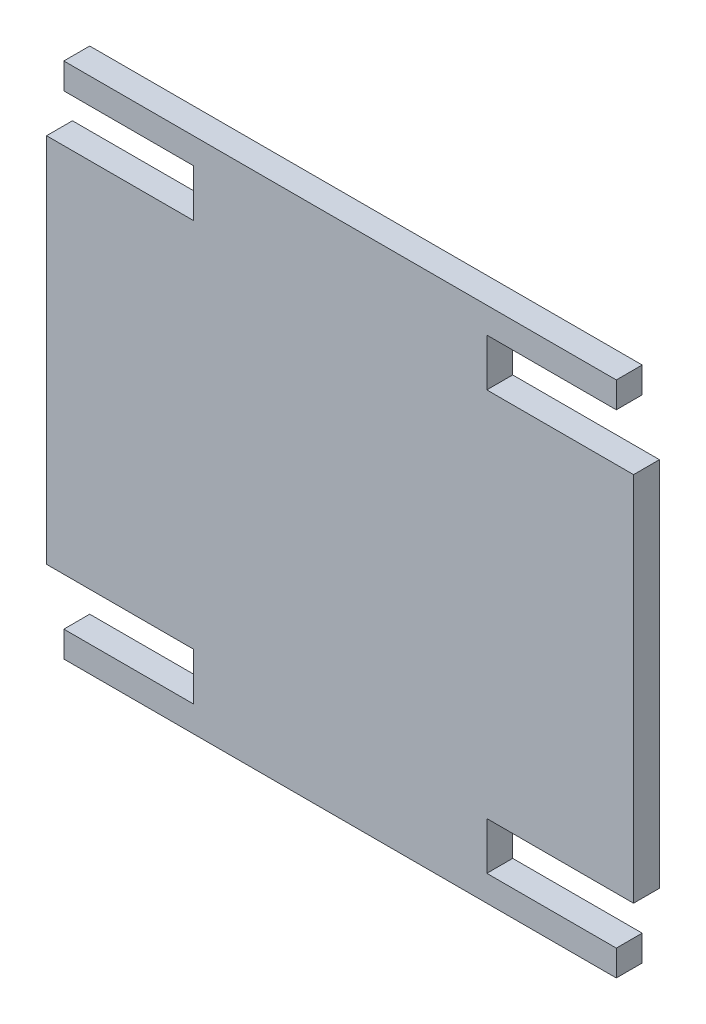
ISO-10303-21;
HEADER;
FILE_DESCRIPTION(('STEP AP214'),'2;1');
FILE_NAME('part.step','',(''),(''),'','','');
FILE_SCHEMA(('AUTOMOTIVE_DESIGN { 1 0 10303 214 1 1 1 1 }'));
ENDSEC;
DATA;
#1=APPLICATION_CONTEXT('core data for automotive mechanical design processes');
#2=APPLICATION_PROTOCOL_DEFINITION('international standard','automotive_design',2000,#1);
#3=PRODUCT_CONTEXT('',#1,'mechanical');
#4=PRODUCT('Part','Part','',(#3));
#5=PRODUCT_RELATED_PRODUCT_CATEGORY('part','',(#4));
#6=PRODUCT_DEFINITION_FORMATION('','',#4);
#7=PRODUCT_DEFINITION_CONTEXT('part definition',#1,'design');
#8=PRODUCT_DEFINITION('design','',#6,#7);
#9=PRODUCT_DEFINITION_SHAPE('','',#8);
#10=(LENGTH_UNIT() NAMED_UNIT(*) SI_UNIT(.MILLI.,.METRE.));
#11=(NAMED_UNIT(*) PLANE_ANGLE_UNIT() SI_UNIT($,.RADIAN.));
#12=(NAMED_UNIT(*) SI_UNIT($,.STERADIAN.) SOLID_ANGLE_UNIT());
#13=UNCERTAINTY_MEASURE_WITH_UNIT(LENGTH_MEASURE(1.E-05),#10,'distance_accuracy_value','');
#14=(GEOMETRIC_REPRESENTATION_CONTEXT(3) GLOBAL_UNCERTAINTY_ASSIGNED_CONTEXT((#13)) GLOBAL_UNIT_ASSIGNED_CONTEXT((#10,
#11,#12)) REPRESENTATION_CONTEXT('',''));
#15=CARTESIAN_POINT('',(0.,0.,0.));
#16=DIRECTION('',(0.,0.,1.));
#17=DIRECTION('',(1.,0.,0.));
#18=AXIS2_PLACEMENT_3D('',#15,#16,#17);
#19=CARTESIAN_POINT('',(-3.19999614,3.00000162,0.2999994));
#20=DIRECTION('',(0.,0.,1.));
#21=DIRECTION('',(1.,0.,0.));
#22=AXIS2_PLACEMENT_3D('',#19,#20,#21);
#23=PLANE('',#22);
#24=DIRECTION('',(0.,1.,0.));
#25=VECTOR('',#24,1.);
#26=CARTESIAN_POINT('',(3.20000122,3.00000162,0.2999994));
#27=LINE('',#26,#25);
#28=CARTESIAN_POINT('',(3.20000122,3.00000162,0.2999994));
#29=VERTEX_POINT('',#28);
#30=CARTESIAN_POINT('',(3.20000122,2.69999968,0.2999994));
#31=VERTEX_POINT('',#30);
#32=EDGE_CURVE('E237',#29,#31,#27,.F.);
#33=ORIENTED_EDGE('',*,*,#32,.F.);
#34=DIRECTION('',(1.,0.,0.));
#35=VECTOR('',#34,1.);
#36=CARTESIAN_POINT('',(-3.19999614,3.00000162,0.2999994));
#37=LINE('',#36,#35);
#38=CARTESIAN_POINT('',(-3.19999614,3.00000162,0.2999994));
#39=VERTEX_POINT('',#38);
#40=EDGE_CURVE('E166',#39,#29,#37,.T.);
#41=ORIENTED_EDGE('',*,*,#40,.F.);
#42=DIRECTION('',(0.,1.,0.));
#43=VECTOR('',#42,1.);
#44=CARTESIAN_POINT('',(-3.19999614,2.70000222,0.2999994));
#45=LINE('',#44,#43);
#46=CARTESIAN_POINT('',(-3.19999614,2.70000222,0.2999994));
#47=VERTEX_POINT('',#46);
#48=EDGE_CURVE('E20',#47,#39,#45,.T.);
#49=ORIENTED_EDGE('',*,*,#48,.F.);
#50=DIRECTION('',(1.,0.,0.));
#51=VECTOR('',#50,1.);
#52=CARTESIAN_POINT('',(-1.69999914,2.70000222,0.2999994));
#53=LINE('',#52,#51);
#54=CARTESIAN_POINT('',(-1.69999914,2.70000222,0.2999994));
#55=VERTEX_POINT('',#54);
#56=EDGE_CURVE('E155',#55,#47,#53,.F.);
#57=ORIENTED_EDGE('',*,*,#56,.F.);
#58=DIRECTION('',(0.,1.,0.));
#59=VECTOR('',#58,1.);
#60=CARTESIAN_POINT('',(-1.69999914,2.15000078,0.2999994));
#61=LINE('',#60,#59);
#62=CARTESIAN_POINT('',(-1.69999914,2.15000078,0.2999994));
#63=VERTEX_POINT('',#62);
#64=EDGE_CURVE('E150',#63,#55,#61,.T.);
#65=ORIENTED_EDGE('',*,*,#64,.F.);
#66=DIRECTION('',(1.,0.,0.));
#67=VECTOR('',#66,1.);
#68=CARTESIAN_POINT('',(-3.39999828,2.15000078,0.2999994));
#69=LINE('',#68,#67);
#70=CARTESIAN_POINT('',(-3.39999828,2.15000078,0.2999994));
#71=VERTEX_POINT('',#70);
#72=EDGE_CURVE('E177',#71,#63,#69,.T.);
#73=ORIENTED_EDGE('',*,*,#72,.F.);
#74=DIRECTION('',(0.,1.,0.));
#75=VECTOR('',#74,1.);
#76=CARTESIAN_POINT('',(-3.39999828,-2.1499957,0.2999994));
#77=LINE('',#76,#75);
#78=CARTESIAN_POINT('',(-3.39999828,-2.1499957,0.2999994));
#79=VERTEX_POINT('',#78);
#80=EDGE_CURVE('E181',#79,#71,#77,.T.);
#81=ORIENTED_EDGE('',*,*,#80,.F.);
#82=DIRECTION('',(1.,0.,0.));
#83=VECTOR('',#82,1.);
#84=CARTESIAN_POINT('',(-1.70000168,-2.1499957,0.2999994));
#85=LINE('',#84,#83);
#86=CARTESIAN_POINT('',(-1.70000168,-2.1499957,0.2999994));
#87=VERTEX_POINT('',#86);
#88=EDGE_CURVE('E185',#87,#79,#85,.F.);
#89=ORIENTED_EDGE('',*,*,#88,.F.);
#90=DIRECTION('',(0.,1.,0.));
#91=VECTOR('',#90,1.);
#92=CARTESIAN_POINT('',(-1.70000168,-2.69999714,0.2999994));
#93=LINE('',#92,#91);
#94=CARTESIAN_POINT('',(-1.70000168,-2.69999714,0.2999994));
#95=VERTEX_POINT('',#94);
#96=EDGE_CURVE('E189',#95,#87,#93,.T.);
#97=ORIENTED_EDGE('',*,*,#96,.F.);
#98=DIRECTION('',(1.,0.,0.));
#99=VECTOR('',#98,1.);
#100=CARTESIAN_POINT('',(-3.19999868,-2.69999714,0.2999994));
#101=LINE('',#100,#99);
#102=CARTESIAN_POINT('',(-3.19999868,-2.69999714,0.2999994));
#103=VERTEX_POINT('',#102);
#104=EDGE_CURVE('E193',#103,#95,#101,.T.);
#105=ORIENTED_EDGE('',*,*,#104,.F.);
#106=DIRECTION('',(0.,1.,0.));
#107=VECTOR('',#106,1.);
#108=CARTESIAN_POINT('',(-3.19999868,-2.99999908,0.2999994));
#109=LINE('',#108,#107);
#110=CARTESIAN_POINT('',(-3.19999868,-2.99999908,0.2999994));
#111=VERTEX_POINT('',#110);
#112=EDGE_CURVE('E197',#111,#103,#109,.T.);
#113=ORIENTED_EDGE('',*,*,#112,.F.);
#114=DIRECTION('',(1.,0.,0.));
#115=VECTOR('',#114,1.);
#116=CARTESIAN_POINT('',(3.19999868,-2.99999908,0.2999994));
#117=LINE('',#116,#115);
#118=CARTESIAN_POINT('',(3.19999868,-2.99999908,0.2999994));
#119=VERTEX_POINT('',#118);
#120=EDGE_CURVE('E201',#119,#111,#117,.F.);
#121=ORIENTED_EDGE('',*,*,#120,.F.);
#122=DIRECTION('',(0.,1.,0.));
#123=VECTOR('',#122,1.);
#124=CARTESIAN_POINT('',(3.19999868,-2.69999968,0.2999994));
#125=LINE('',#124,#123);
#126=CARTESIAN_POINT('',(3.19999868,-2.69999968,0.2999994));
#127=VERTEX_POINT('',#126);
#128=EDGE_CURVE('E205',#127,#119,#125,.F.);
#129=ORIENTED_EDGE('',*,*,#128,.F.);
#130=DIRECTION('',(1.,0.,0.));
#131=VECTOR('',#130,1.);
#132=CARTESIAN_POINT('',(1.70000168,-2.69999968,0.2999994));
#133=LINE('',#132,#131);
#134=CARTESIAN_POINT('',(1.70000168,-2.69999968,0.2999994));
#135=VERTEX_POINT('',#134);
#136=EDGE_CURVE('E209',#135,#127,#133,.T.);
#137=ORIENTED_EDGE('',*,*,#136,.F.);
#138=DIRECTION('',(0.,1.,0.));
#139=VECTOR('',#138,1.);
#140=CARTESIAN_POINT('',(1.70000168,-2.14999824,0.2999994));
#141=LINE('',#140,#139);
#142=CARTESIAN_POINT('',(1.70000168,-2.14999824,0.2999994));
#143=VERTEX_POINT('',#142);
#144=EDGE_CURVE('E213',#143,#135,#141,.F.);
#145=ORIENTED_EDGE('',*,*,#144,.F.);
#146=DIRECTION('',(1.,0.,0.));
#147=VECTOR('',#146,1.);
#148=CARTESIAN_POINT('',(3.40000082,-2.14999824,0.2999994));
#149=LINE('',#148,#147);
#150=CARTESIAN_POINT('',(3.40000082,-2.14999824,0.2999994));
#151=VERTEX_POINT('',#150);
#152=EDGE_CURVE('E217',#151,#143,#149,.F.);
#153=ORIENTED_EDGE('',*,*,#152,.F.);
#154=DIRECTION('',(0.,1.,0.));
#155=VECTOR('',#154,1.);
#156=CARTESIAN_POINT('',(3.40000082,2.14999824,0.2999994));
#157=LINE('',#156,#155);
#158=CARTESIAN_POINT('',(3.40000082,2.14999824,0.2999994));
#159=VERTEX_POINT('',#158);
#160=EDGE_CURVE('E221',#159,#151,#157,.F.);
#161=ORIENTED_EDGE('',*,*,#160,.F.);
#162=DIRECTION('',(1.,0.,0.));
#163=VECTOR('',#162,1.);
#164=CARTESIAN_POINT('',(1.70000422,2.14999824,0.2999994));
#165=LINE('',#164,#163);
#166=CARTESIAN_POINT('',(1.70000422,2.14999824,0.2999994));
#167=VERTEX_POINT('',#166);
#168=EDGE_CURVE('E225',#167,#159,#165,.T.);
#169=ORIENTED_EDGE('',*,*,#168,.F.);
#170=DIRECTION('',(0.,1.,0.));
#171=VECTOR('',#170,1.);
#172=CARTESIAN_POINT('',(1.70000422,2.69999968,0.2999994));
#173=LINE('',#172,#171);
#174=CARTESIAN_POINT('',(1.70000422,2.69999968,0.2999994));
#175=VERTEX_POINT('',#174);
#176=EDGE_CURVE('E229',#175,#167,#173,.F.);
#177=ORIENTED_EDGE('',*,*,#176,.F.);
#178=DIRECTION('',(1.,0.,0.));
#179=VECTOR('',#178,1.);
#180=CARTESIAN_POINT('',(3.20000122,2.69999968,0.2999994));
#181=LINE('',#180,#179);
#182=EDGE_CURVE('E233',#31,#175,#181,.F.);
#183=ORIENTED_EDGE('',*,*,#182,.F.);
#184=EDGE_LOOP('',(#33,#41,#49,#57,#65,#73,#81,#89,#97,#105,#113,#121,#129,#137,#145,#153,#161,
#169,#177,#183));
#185=FACE_BOUND('',#184,.T.);
#186=ADVANCED_FACE('F17',(#185),#23,.T.);
#187=CARTESIAN_POINT('',(-3.19999614,2.70000222,0.));
#188=DIRECTION('',(-1.,0.,0.));
#189=DIRECTION('',(0.,0.,1.));
#190=AXIS2_PLACEMENT_3D('',#187,#188,#189);
#191=PLANE('',#190);
#192=DIRECTION('',(0.,0.,1.));
#193=VECTOR('',#192,1.);
#194=CARTESIAN_POINT('',(-3.19999614,3.00000162,0.));
#195=LINE('',#194,#193);
#196=CARTESIAN_POINT('',(-3.19999614,3.00000162,0.));
#197=VERTEX_POINT('',#196);
#198=EDGE_CURVE('E241',#197,#39,#195,.T.);
#199=ORIENTED_EDGE('',*,*,#198,.F.);
#200=DIRECTION('',(0.,1.,0.));
#201=VECTOR('',#200,1.);
#202=CARTESIAN_POINT('',(-3.19999614,3.00000162,0.));
#203=LINE('',#202,#201);
#204=CARTESIAN_POINT('',(-3.19999614,2.70000222,0.));
#205=VERTEX_POINT('',#204);
#206=EDGE_CURVE('E172',#197,#205,#203,.F.);
#207=ORIENTED_EDGE('',*,*,#206,.T.);
#208=DIRECTION('',(0.,0.,-1.));
#209=VECTOR('',#208,1.);
#210=CARTESIAN_POINT('',(-3.19999614,2.70000222,0.));
#211=LINE('',#210,#209);
#212=EDGE_CURVE('E160',#47,#205,#211,.T.);
#213=ORIENTED_EDGE('',*,*,#212,.F.);
#214=ORIENTED_EDGE('',*,*,#48,.T.);
#215=EDGE_LOOP('',(#199,#207,#213,#214));
#216=FACE_BOUND('',#215,.T.);
#217=ADVANCED_FACE('F171',(#216),#191,.T.);
#218=CARTESIAN_POINT('',(-1.69999914,2.70000222,0.));
#219=DIRECTION('',(0.,-1.,0.));
#220=DIRECTION('',(0.,0.,-1.));
#221=AXIS2_PLACEMENT_3D('',#218,#219,#220);
#222=PLANE('',#221);
#223=ORIENTED_EDGE('',*,*,#212,.T.);
#224=DIRECTION('',(1.,0.,0.));
#225=VECTOR('',#224,1.);
#226=CARTESIAN_POINT('',(-3.19999614,2.70000222,0.));
#227=LINE('',#226,#225);
#228=CARTESIAN_POINT('',(-1.69999914,2.70000222,0.));
#229=VERTEX_POINT('',#228);
#230=EDGE_CURVE('E246',#205,#229,#227,.T.);
#231=ORIENTED_EDGE('',*,*,#230,.T.);
#232=DIRECTION('',(0.,0.,1.));
#233=VECTOR('',#232,1.);
#234=CARTESIAN_POINT('',(-1.69999914,2.70000222,0.));
#235=LINE('',#234,#233);
#236=EDGE_CURVE('E162',#55,#229,#235,.F.);
#237=ORIENTED_EDGE('',*,*,#236,.F.);
#238=ORIENTED_EDGE('',*,*,#56,.T.);
#239=EDGE_LOOP('',(#223,#231,#237,#238));
#240=FACE_BOUND('',#239,.T.);
#241=ADVANCED_FACE('F157',(#240),#222,.T.);
#242=CARTESIAN_POINT('',(-1.69999914,2.15000078,0.));
#243=DIRECTION('',(-1.,0.,0.));
#244=DIRECTION('',(0.,0.,1.));
#245=AXIS2_PLACEMENT_3D('',#242,#243,#244);
#246=PLANE('',#245);
#247=ORIENTED_EDGE('',*,*,#236,.T.);
#248=DIRECTION('',(0.,1.,0.));
#249=VECTOR('',#248,1.);
#250=CARTESIAN_POINT('',(-1.69999914,3.00000162,0.));
#251=LINE('',#250,#249);
#252=CARTESIAN_POINT('',(-1.69999914,2.15000078,0.));
#253=VERTEX_POINT('',#252);
#254=EDGE_CURVE('E248',#229,#253,#251,.F.);
#255=ORIENTED_EDGE('',*,*,#254,.T.);
#256=DIRECTION('',(0.,0.,1.));
#257=VECTOR('',#256,1.);
#258=CARTESIAN_POINT('',(-1.69999914,2.15000078,0.));
#259=LINE('',#258,#257);
#260=EDGE_CURVE('E179',#63,#253,#259,.F.);
#261=ORIENTED_EDGE('',*,*,#260,.F.);
#262=ORIENTED_EDGE('',*,*,#64,.T.);
#263=EDGE_LOOP('',(#247,#255,#261,#262));
#264=FACE_BOUND('',#263,.T.);
#265=ADVANCED_FACE('F378',(#264),#246,.T.);
#266=CARTESIAN_POINT('',(-3.39999828,2.15000078,0.));
#267=DIRECTION('',(0.,1.,0.));
#268=DIRECTION('',(0.,0.,1.));
#269=AXIS2_PLACEMENT_3D('',#266,#267,#268);
#270=PLANE('',#269);
#271=ORIENTED_EDGE('',*,*,#260,.T.);
#272=DIRECTION('',(1.,0.,0.));
#273=VECTOR('',#272,1.);
#274=CARTESIAN_POINT('',(-3.19999614,2.15000078,0.));
#275=LINE('',#274,#273);
#276=CARTESIAN_POINT('',(-3.39999828,2.15000078,0.));
#277=VERTEX_POINT('',#276);
#278=EDGE_CURVE('E251',#253,#277,#275,.F.);
#279=ORIENTED_EDGE('',*,*,#278,.T.);
#280=DIRECTION('',(0.,0.,1.));
#281=VECTOR('',#280,1.);
#282=CARTESIAN_POINT('',(-3.39999828,2.15000078,0.));
#283=LINE('',#282,#281);
#284=EDGE_CURVE('E183',#71,#277,#283,.F.);
#285=ORIENTED_EDGE('',*,*,#284,.F.);
#286=ORIENTED_EDGE('',*,*,#72,.T.);
#287=EDGE_LOOP('',(#271,#279,#285,#286));
#288=FACE_BOUND('',#287,.T.);
#289=ADVANCED_FACE('F377',(#288),#270,.T.);
#290=CARTESIAN_POINT('',(-3.39999828,-2.1499957,0.));
#291=DIRECTION('',(-1.,0.,0.));
#292=DIRECTION('',(0.,0.,1.));
#293=AXIS2_PLACEMENT_3D('',#290,#291,#292);
#294=PLANE('',#293);
#295=ORIENTED_EDGE('',*,*,#284,.T.);
#296=DIRECTION('',(0.,1.,0.));
#297=VECTOR('',#296,1.);
#298=CARTESIAN_POINT('',(-3.39999828,3.00000162,0.));
#299=LINE('',#298,#297);
#300=CARTESIAN_POINT('',(-3.39999828,-2.1499957,0.));
#301=VERTEX_POINT('',#300);
#302=EDGE_CURVE('E254',#277,#301,#299,.F.);
#303=ORIENTED_EDGE('',*,*,#302,.T.);
#304=DIRECTION('',(0.,0.,-1.));
#305=VECTOR('',#304,1.);
#306=CARTESIAN_POINT('',(-3.39999828,-2.1499957,0.));
#307=LINE('',#306,#305);
#308=EDGE_CURVE('E187',#79,#301,#307,.T.);
#309=ORIENTED_EDGE('',*,*,#308,.F.);
#310=ORIENTED_EDGE('',*,*,#80,.T.);
#311=EDGE_LOOP('',(#295,#303,#309,#310));
#312=FACE_BOUND('',#311,.T.);
#313=ADVANCED_FACE('F371',(#312),#294,.T.);
#314=CARTESIAN_POINT('',(-1.70000168,-2.1499957,0.));
#315=DIRECTION('',(0.,-1.,0.));
#316=DIRECTION('',(0.,0.,-1.));
#317=AXIS2_PLACEMENT_3D('',#314,#315,#316);
#318=PLANE('',#317);
#319=ORIENTED_EDGE('',*,*,#308,.T.);
#320=DIRECTION('',(1.,0.,0.));
#321=VECTOR('',#320,1.);
#322=CARTESIAN_POINT('',(-3.19999614,-2.1499957,0.));
#323=LINE('',#322,#321);
#324=CARTESIAN_POINT('',(-1.70000168,-2.1499957,0.));
#325=VERTEX_POINT('',#324);
#326=EDGE_CURVE('E257',#301,#325,#323,.T.);
#327=ORIENTED_EDGE('',*,*,#326,.T.);
#328=DIRECTION('',(0.,0.,1.));
#329=VECTOR('',#328,1.);
#330=CARTESIAN_POINT('',(-1.70000168,-2.1499957,0.));
#331=LINE('',#330,#329);
#332=EDGE_CURVE('E191',#87,#325,#331,.F.);
#333=ORIENTED_EDGE('',*,*,#332,.F.);
#334=ORIENTED_EDGE('',*,*,#88,.T.);
#335=EDGE_LOOP('',(#319,#327,#333,#334));
#336=FACE_BOUND('',#335,.T.);
#337=ADVANCED_FACE('F367',(#336),#318,.T.);
#338=CARTESIAN_POINT('',(-1.70000168,-2.69999714,0.));
#339=DIRECTION('',(-1.,0.,0.));
#340=DIRECTION('',(0.,0.,1.));
#341=AXIS2_PLACEMENT_3D('',#338,#339,#340);
#342=PLANE('',#341);
#343=ORIENTED_EDGE('',*,*,#332,.T.);
#344=DIRECTION('',(0.,1.,0.));
#345=VECTOR('',#344,1.);
#346=CARTESIAN_POINT('',(-1.70000168,3.00000162,0.));
#347=LINE('',#346,#345);
#348=CARTESIAN_POINT('',(-1.70000168,-2.69999714,0.));
#349=VERTEX_POINT('',#348);
#350=EDGE_CURVE('E260',#325,#349,#347,.F.);
#351=ORIENTED_EDGE('',*,*,#350,.T.);
#352=DIRECTION('',(0.,0.,1.));
#353=VECTOR('',#352,1.);
#354=CARTESIAN_POINT('',(-1.70000168,-2.69999714,0.));
#355=LINE('',#354,#353);
#356=EDGE_CURVE('E195',#95,#349,#355,.F.);
#357=ORIENTED_EDGE('',*,*,#356,.F.);
#358=ORIENTED_EDGE('',*,*,#96,.T.);
#359=EDGE_LOOP('',(#343,#351,#357,#358));
#360=FACE_BOUND('',#359,.T.);
#361=ADVANCED_FACE('F361',(#360),#342,.T.);
#362=CARTESIAN_POINT('',(-3.19999868,-2.69999714,0.));
#363=DIRECTION('',(0.,1.,0.));
#364=DIRECTION('',(0.,0.,1.));
#365=AXIS2_PLACEMENT_3D('',#362,#363,#364);
#366=PLANE('',#365);
#367=ORIENTED_EDGE('',*,*,#356,.T.);
#368=DIRECTION('',(1.,0.,0.));
#369=VECTOR('',#368,1.);
#370=CARTESIAN_POINT('',(-3.19999614,-2.69999714,0.));
#371=LINE('',#370,#369);
#372=CARTESIAN_POINT('',(-3.19999868,-2.69999714,0.));
#373=VERTEX_POINT('',#372);
#374=EDGE_CURVE('E263',#349,#373,#371,.F.);
#375=ORIENTED_EDGE('',*,*,#374,.T.);
#376=DIRECTION('',(0.,0.,1.));
#377=VECTOR('',#376,1.);
#378=CARTESIAN_POINT('',(-3.19999868,-2.69999714,0.));
#379=LINE('',#378,#377);
#380=EDGE_CURVE('E199',#103,#373,#379,.F.);
#381=ORIENTED_EDGE('',*,*,#380,.F.);
#382=ORIENTED_EDGE('',*,*,#104,.T.);
#383=EDGE_LOOP('',(#367,#375,#381,#382));
#384=FACE_BOUND('',#383,.T.);
#385=ADVANCED_FACE('F357',(#384),#366,.T.);
#386=CARTESIAN_POINT('',(-3.19999868,-2.99999908,0.));
#387=DIRECTION('',(-1.,0.,0.));
#388=DIRECTION('',(0.,0.,1.));
#389=AXIS2_PLACEMENT_3D('',#386,#387,#388);
#390=PLANE('',#389);
#391=ORIENTED_EDGE('',*,*,#380,.T.);
#392=DIRECTION('',(0.,1.,0.));
#393=VECTOR('',#392,1.);
#394=CARTESIAN_POINT('',(-3.19999868,3.00000162,0.));
#395=LINE('',#394,#393);
#396=CARTESIAN_POINT('',(-3.19999868,-2.99999908,0.));
#397=VERTEX_POINT('',#396);
#398=EDGE_CURVE('E266',#373,#397,#395,.F.);
#399=ORIENTED_EDGE('',*,*,#398,.T.);
#400=DIRECTION('',(0.,0.,-1.));
#401=VECTOR('',#400,1.);
#402=CARTESIAN_POINT('',(-3.19999868,-2.99999908,0.));
#403=LINE('',#402,#401);
#404=EDGE_CURVE('E203',#111,#397,#403,.T.);
#405=ORIENTED_EDGE('',*,*,#404,.F.);
#406=ORIENTED_EDGE('',*,*,#112,.T.);
#407=EDGE_LOOP('',(#391,#399,#405,#406));
#408=FACE_BOUND('',#407,.T.);
#409=ADVANCED_FACE('F351',(#408),#390,.T.);
#410=CARTESIAN_POINT('',(3.19999868,-2.99999908,0.));
#411=DIRECTION('',(0.,-1.,0.));
#412=DIRECTION('',(0.,0.,-1.));
#413=AXIS2_PLACEMENT_3D('',#410,#411,#412);
#414=PLANE('',#413);
#415=ORIENTED_EDGE('',*,*,#404,.T.);
#416=DIRECTION('',(1.,0.,0.));
#417=VECTOR('',#416,1.);
#418=CARTESIAN_POINT('',(-3.19999614,-2.99999908,0.));
#419=LINE('',#418,#417);
#420=CARTESIAN_POINT('',(3.19999868,-2.99999908,0.));
#421=VERTEX_POINT('',#420);
#422=EDGE_CURVE('E269',#397,#421,#419,.T.);
#423=ORIENTED_EDGE('',*,*,#422,.T.);
#424=DIRECTION('',(0.,0.,-1.));
#425=VECTOR('',#424,1.);
#426=CARTESIAN_POINT('',(3.19999868,-2.99999908,0.));
#427=LINE('',#426,#425);
#428=EDGE_CURVE('E207',#119,#421,#427,.T.);
#429=ORIENTED_EDGE('',*,*,#428,.F.);
#430=ORIENTED_EDGE('',*,*,#120,.T.);
#431=EDGE_LOOP('',(#415,#423,#429,#430));
#432=FACE_BOUND('',#431,.T.);
#433=ADVANCED_FACE('F347',(#432),#414,.T.);
#434=CARTESIAN_POINT('',(3.19999868,-2.69999968,0.));
#435=DIRECTION('',(1.,0.,0.));
#436=DIRECTION('',(0.,0.,-1.));
#437=AXIS2_PLACEMENT_3D('',#434,#435,#436);
#438=PLANE('',#437);
#439=ORIENTED_EDGE('',*,*,#428,.T.);
#440=DIRECTION('',(0.,1.,0.));
#441=VECTOR('',#440,1.);
#442=CARTESIAN_POINT('',(3.19999868,3.00000162,0.));
#443=LINE('',#442,#441);
#444=CARTESIAN_POINT('',(3.19999868,-2.69999968,0.));
#445=VERTEX_POINT('',#444);
#446=EDGE_CURVE('E272',#421,#445,#443,.T.);
#447=ORIENTED_EDGE('',*,*,#446,.T.);
#448=DIRECTION('',(0.,0.,1.));
#449=VECTOR('',#448,1.);
#450=CARTESIAN_POINT('',(3.19999868,-2.69999968,0.));
#451=LINE('',#450,#449);
#452=EDGE_CURVE('E211',#127,#445,#451,.F.);
#453=ORIENTED_EDGE('',*,*,#452,.F.);
#454=ORIENTED_EDGE('',*,*,#128,.T.);
#455=EDGE_LOOP('',(#439,#447,#453,#454));
#456=FACE_BOUND('',#455,.T.);
#457=ADVANCED_FACE('F341',(#456),#438,.T.);
#458=CARTESIAN_POINT('',(1.70000168,-2.69999968,0.));
#459=DIRECTION('',(0.,1.,0.));
#460=DIRECTION('',(0.,0.,1.));
#461=AXIS2_PLACEMENT_3D('',#458,#459,#460);
#462=PLANE('',#461);
#463=ORIENTED_EDGE('',*,*,#452,.T.);
#464=DIRECTION('',(1.,0.,0.));
#465=VECTOR('',#464,1.);
#466=CARTESIAN_POINT('',(-3.19999614,-2.69999968,0.));
#467=LINE('',#466,#465);
#468=CARTESIAN_POINT('',(1.70000168,-2.69999968,0.));
#469=VERTEX_POINT('',#468);
#470=EDGE_CURVE('E275',#445,#469,#467,.F.);
#471=ORIENTED_EDGE('',*,*,#470,.T.);
#472=DIRECTION('',(0.,0.,-1.));
#473=VECTOR('',#472,1.);
#474=CARTESIAN_POINT('',(1.70000168,-2.69999968,0.));
#475=LINE('',#474,#473);
#476=EDGE_CURVE('E215',#135,#469,#475,.T.);
#477=ORIENTED_EDGE('',*,*,#476,.F.);
#478=ORIENTED_EDGE('',*,*,#136,.T.);
#479=EDGE_LOOP('',(#463,#471,#477,#478));
#480=FACE_BOUND('',#479,.T.);
#481=ADVANCED_FACE('F337',(#480),#462,.T.);
#482=CARTESIAN_POINT('',(1.70000168,-2.14999824,0.));
#483=DIRECTION('',(1.,0.,0.));
#484=DIRECTION('',(0.,0.,-1.));
#485=AXIS2_PLACEMENT_3D('',#482,#483,#484);
#486=PLANE('',#485);
#487=ORIENTED_EDGE('',*,*,#476,.T.);
#488=DIRECTION('',(0.,1.,0.));
#489=VECTOR('',#488,1.);
#490=CARTESIAN_POINT('',(1.70000168,3.00000162,0.));
#491=LINE('',#490,#489);
#492=CARTESIAN_POINT('',(1.70000168,-2.14999824,0.));
#493=VERTEX_POINT('',#492);
#494=EDGE_CURVE('E278',#469,#493,#491,.T.);
#495=ORIENTED_EDGE('',*,*,#494,.T.);
#496=DIRECTION('',(0.,0.,-1.));
#497=VECTOR('',#496,1.);
#498=CARTESIAN_POINT('',(1.70000168,-2.14999824,0.));
#499=LINE('',#498,#497);
#500=EDGE_CURVE('E219',#143,#493,#499,.T.);
#501=ORIENTED_EDGE('',*,*,#500,.F.);
#502=ORIENTED_EDGE('',*,*,#144,.T.);
#503=EDGE_LOOP('',(#487,#495,#501,#502));
#504=FACE_BOUND('',#503,.T.);
#505=ADVANCED_FACE('F331',(#504),#486,.T.);
#506=CARTESIAN_POINT('',(3.40000082,-2.14999824,0.));
#507=DIRECTION('',(0.,-1.,0.));
#508=DIRECTION('',(0.,0.,-1.));
#509=AXIS2_PLACEMENT_3D('',#506,#507,#508);
#510=PLANE('',#509);
#511=ORIENTED_EDGE('',*,*,#500,.T.);
#512=DIRECTION('',(1.,0.,0.));
#513=VECTOR('',#512,1.);
#514=CARTESIAN_POINT('',(-3.19999614,-2.14999824,0.));
#515=LINE('',#514,#513);
#516=CARTESIAN_POINT('',(3.40000082,-2.14999824,0.));
#517=VERTEX_POINT('',#516);
#518=EDGE_CURVE('E281',#493,#517,#515,.T.);
#519=ORIENTED_EDGE('',*,*,#518,.T.);
#520=DIRECTION('',(0.,0.,-1.));
#521=VECTOR('',#520,1.);
#522=CARTESIAN_POINT('',(3.40000082,-2.14999824,0.));
#523=LINE('',#522,#521);
#524=EDGE_CURVE('E223',#151,#517,#523,.T.);
#525=ORIENTED_EDGE('',*,*,#524,.F.);
#526=ORIENTED_EDGE('',*,*,#152,.T.);
#527=EDGE_LOOP('',(#511,#519,#525,#526));
#528=FACE_BOUND('',#527,.T.);
#529=ADVANCED_FACE('F327',(#528),#510,.T.);
#530=CARTESIAN_POINT('',(3.40000082,2.14999824,0.));
#531=DIRECTION('',(1.,0.,0.));
#532=DIRECTION('',(0.,0.,-1.));
#533=AXIS2_PLACEMENT_3D('',#530,#531,#532);
#534=PLANE('',#533);
#535=ORIENTED_EDGE('',*,*,#524,.T.);
#536=DIRECTION('',(0.,1.,0.));
#537=VECTOR('',#536,1.);
#538=CARTESIAN_POINT('',(3.40000082,3.00000162,0.));
#539=LINE('',#538,#537);
#540=CARTESIAN_POINT('',(3.40000082,2.14999824,0.));
#541=VERTEX_POINT('',#540);
#542=EDGE_CURVE('E284',#517,#541,#539,.T.);
#543=ORIENTED_EDGE('',*,*,#542,.T.);
#544=DIRECTION('',(0.,0.,1.));
#545=VECTOR('',#544,1.);
#546=CARTESIAN_POINT('',(3.40000082,2.14999824,0.));
#547=LINE('',#546,#545);
#548=EDGE_CURVE('E227',#159,#541,#547,.F.);
#549=ORIENTED_EDGE('',*,*,#548,.F.);
#550=ORIENTED_EDGE('',*,*,#160,.T.);
#551=EDGE_LOOP('',(#535,#543,#549,#550));
#552=FACE_BOUND('',#551,.T.);
#553=ADVANCED_FACE('F321',(#552),#534,.T.);
#554=CARTESIAN_POINT('',(1.70000422,2.14999824,0.));
#555=DIRECTION('',(0.,1.,0.));
#556=DIRECTION('',(0.,0.,1.));
#557=AXIS2_PLACEMENT_3D('',#554,#555,#556);
#558=PLANE('',#557);
#559=ORIENTED_EDGE('',*,*,#548,.T.);
#560=DIRECTION('',(1.,0.,0.));
#561=VECTOR('',#560,1.);
#562=CARTESIAN_POINT('',(-3.19999614,2.14999824,0.));
#563=LINE('',#562,#561);
#564=CARTESIAN_POINT('',(1.70000422,2.14999824,0.));
#565=VERTEX_POINT('',#564);
#566=EDGE_CURVE('E287',#541,#565,#563,.F.);
#567=ORIENTED_EDGE('',*,*,#566,.T.);
#568=DIRECTION('',(0.,0.,-1.));
#569=VECTOR('',#568,1.);
#570=CARTESIAN_POINT('',(1.70000422,2.14999824,0.));
#571=LINE('',#570,#569);
#572=EDGE_CURVE('E231',#167,#565,#571,.T.);
#573=ORIENTED_EDGE('',*,*,#572,.F.);
#574=ORIENTED_EDGE('',*,*,#168,.T.);
#575=EDGE_LOOP('',(#559,#567,#573,#574));
#576=FACE_BOUND('',#575,.T.);
#577=ADVANCED_FACE('F317',(#576),#558,.T.);
#578=CARTESIAN_POINT('',(1.70000422,2.69999968,0.));
#579=DIRECTION('',(1.,0.,0.));
#580=DIRECTION('',(0.,0.,-1.));
#581=AXIS2_PLACEMENT_3D('',#578,#579,#580);
#582=PLANE('',#581);
#583=ORIENTED_EDGE('',*,*,#572,.T.);
#584=DIRECTION('',(0.,1.,0.));
#585=VECTOR('',#584,1.);
#586=CARTESIAN_POINT('',(1.70000422,3.00000162,0.));
#587=LINE('',#586,#585);
#588=CARTESIAN_POINT('',(1.70000422,2.69999968,0.));
#589=VERTEX_POINT('',#588);
#590=EDGE_CURVE('E290',#565,#589,#587,.T.);
#591=ORIENTED_EDGE('',*,*,#590,.T.);
#592=DIRECTION('',(0.,0.,-1.));
#593=VECTOR('',#592,1.);
#594=CARTESIAN_POINT('',(1.70000422,2.69999968,0.));
#595=LINE('',#594,#593);
#596=EDGE_CURVE('E235',#175,#589,#595,.T.);
#597=ORIENTED_EDGE('',*,*,#596,.F.);
#598=ORIENTED_EDGE('',*,*,#176,.T.);
#599=EDGE_LOOP('',(#583,#591,#597,#598));
#600=FACE_BOUND('',#599,.T.);
#601=ADVANCED_FACE('F311',(#600),#582,.T.);
#602=CARTESIAN_POINT('',(3.20000122,2.69999968,0.));
#603=DIRECTION('',(0.,-1.,0.));
#604=DIRECTION('',(0.,0.,-1.));
#605=AXIS2_PLACEMENT_3D('',#602,#603,#604);
#606=PLANE('',#605);
#607=ORIENTED_EDGE('',*,*,#596,.T.);
#608=DIRECTION('',(1.,0.,0.));
#609=VECTOR('',#608,1.);
#610=CARTESIAN_POINT('',(-3.19999614,2.69999968,0.));
#611=LINE('',#610,#609);
#612=CARTESIAN_POINT('',(3.20000122,2.69999968,0.));
#613=VERTEX_POINT('',#612);
#614=EDGE_CURVE('E293',#589,#613,#611,.T.);
#615=ORIENTED_EDGE('',*,*,#614,.T.);
#616=DIRECTION('',(0.,0.,-1.));
#617=VECTOR('',#616,1.);
#618=CARTESIAN_POINT('',(3.20000122,2.69999968,0.));
#619=LINE('',#618,#617);
#620=EDGE_CURVE('E239',#31,#613,#619,.T.);
#621=ORIENTED_EDGE('',*,*,#620,.F.);
#622=ORIENTED_EDGE('',*,*,#182,.T.);
#623=EDGE_LOOP('',(#607,#615,#621,#622));
#624=FACE_BOUND('',#623,.T.);
#625=ADVANCED_FACE('F306',(#624),#606,.T.);
#626=CARTESIAN_POINT('',(3.20000122,3.00000162,0.));
#627=DIRECTION('',(1.,0.,0.));
#628=DIRECTION('',(0.,0.,-1.));
#629=AXIS2_PLACEMENT_3D('',#626,#627,#628);
#630=PLANE('',#629);
#631=ORIENTED_EDGE('',*,*,#620,.T.);
#632=DIRECTION('',(0.,1.,0.));
#633=VECTOR('',#632,1.);
#634=CARTESIAN_POINT('',(3.20000122,3.00000162,0.));
#635=LINE('',#634,#633);
#636=CARTESIAN_POINT('',(3.20000122,3.00000162,0.));
#637=VERTEX_POINT('',#636);
#638=EDGE_CURVE('E26',#613,#637,#635,.T.);
#639=ORIENTED_EDGE('',*,*,#638,.T.);
#640=DIRECTION('',(0.,0.,1.));
#641=VECTOR('',#640,1.);
#642=CARTESIAN_POINT('',(3.20000122,3.00000162,0.));
#643=LINE('',#642,#641);
#644=EDGE_CURVE('E34',#29,#637,#643,.F.);
#645=ORIENTED_EDGE('',*,*,#644,.F.);
#646=ORIENTED_EDGE('',*,*,#32,.T.);
#647=EDGE_LOOP('',(#631,#639,#645,#646));
#648=FACE_BOUND('',#647,.T.);
#649=ADVANCED_FACE('F299',(#648),#630,.T.);
#650=CARTESIAN_POINT('',(-3.19999614,3.00000162,0.));
#651=DIRECTION('',(0.,1.,0.));
#652=DIRECTION('',(0.,0.,1.));
#653=AXIS2_PLACEMENT_3D('',#650,#651,#652);
#654=PLANE('',#653);
#655=ORIENTED_EDGE('',*,*,#644,.T.);
#656=DIRECTION('',(1.,0.,0.));
#657=VECTOR('',#656,1.);
#658=CARTESIAN_POINT('',(-3.19999614,3.00000162,0.));
#659=LINE('',#658,#657);
#660=EDGE_CURVE('E11',#637,#197,#659,.F.);
#661=ORIENTED_EDGE('',*,*,#660,.T.);
#662=ORIENTED_EDGE('',*,*,#198,.T.);
#663=ORIENTED_EDGE('',*,*,#40,.T.);
#664=EDGE_LOOP('',(#655,#661,#662,#663));
#665=FACE_BOUND('',#664,.T.);
#666=ADVANCED_FACE('F379',(#665),#654,.T.);
#667=CARTESIAN_POINT('',(-3.19999614,3.00000162,0.));
#668=DIRECTION('',(0.,0.,1.));
#669=DIRECTION('',(1.,0.,0.));
#670=AXIS2_PLACEMENT_3D('',#667,#668,#669);
#671=PLANE('',#670);
#672=ORIENTED_EDGE('',*,*,#638,.F.);
#673=ORIENTED_EDGE('',*,*,#614,.F.);
#674=ORIENTED_EDGE('',*,*,#590,.F.);
#675=ORIENTED_EDGE('',*,*,#566,.F.);
#676=ORIENTED_EDGE('',*,*,#542,.F.);
#677=ORIENTED_EDGE('',*,*,#518,.F.);
#678=ORIENTED_EDGE('',*,*,#494,.F.);
#679=ORIENTED_EDGE('',*,*,#470,.F.);
#680=ORIENTED_EDGE('',*,*,#446,.F.);
#681=ORIENTED_EDGE('',*,*,#422,.F.);
#682=ORIENTED_EDGE('',*,*,#398,.F.);
#683=ORIENTED_EDGE('',*,*,#374,.F.);
#684=ORIENTED_EDGE('',*,*,#350,.F.);
#685=ORIENTED_EDGE('',*,*,#326,.F.);
#686=ORIENTED_EDGE('',*,*,#302,.F.);
#687=ORIENTED_EDGE('',*,*,#278,.F.);
#688=ORIENTED_EDGE('',*,*,#254,.F.);
#689=ORIENTED_EDGE('',*,*,#230,.F.);
#690=ORIENTED_EDGE('',*,*,#206,.F.);
#691=ORIENTED_EDGE('',*,*,#660,.F.);
#692=EDGE_LOOP('',(#672,#673,#674,#675,#676,#677,#678,#679,#680,#681,#682,#683,#684,#685,#686,
#687,#688,#689,#690,#691));
#693=FACE_BOUND('',#692,.T.);
#694=ADVANCED_FACE('F303',(#693),#671,.F.);
#695=CLOSED_SHELL('',(#186,#217,#241,#265,#289,#313,#337,#361,#385,#409,#433,#457,#481,#505,
#529,#553,#577,#601,#625,#649,#666,#694));
#696=MANIFOLD_SOLID_BREP('B1',#695);
#697=ADVANCED_BREP_SHAPE_REPRESENTATION('',(#18,#696),#14);
#698=SHAPE_DEFINITION_REPRESENTATION(#9,#697);
ENDSEC;
END-ISO-10303-21;
